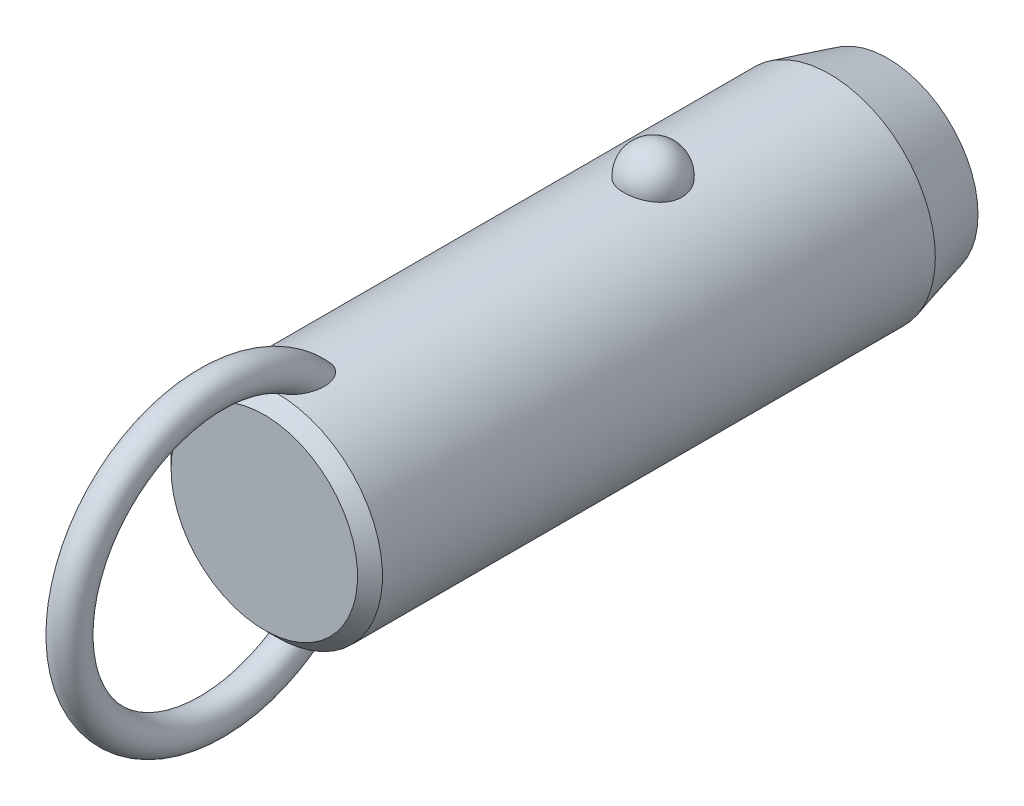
ISO-10303-21;
HEADER;
FILE_DESCRIPTION(('STEP AP214'),'2;1');
FILE_NAME('part.step','',(''),(''),'','','');
FILE_SCHEMA(('AUTOMOTIVE_DESIGN { 1 0 10303 214 1 1 1 1 }'));
ENDSEC;
DATA;
#1=APPLICATION_CONTEXT('core data for automotive mechanical design processes');
#2=APPLICATION_PROTOCOL_DEFINITION('international standard','automotive_design',2000,#1);
#3=PRODUCT_CONTEXT('',#1,'mechanical');
#4=PRODUCT('Part','Part','',(#3));
#5=PRODUCT_RELATED_PRODUCT_CATEGORY('part','',(#4));
#6=PRODUCT_DEFINITION_FORMATION('','',#4);
#7=PRODUCT_DEFINITION_CONTEXT('part definition',#1,'design');
#8=PRODUCT_DEFINITION('design','',#6,#7);
#9=PRODUCT_DEFINITION_SHAPE('','',#8);
#10=(LENGTH_UNIT() NAMED_UNIT(*) SI_UNIT(.MILLI.,.METRE.));
#11=(NAMED_UNIT(*) PLANE_ANGLE_UNIT() SI_UNIT($,.RADIAN.));
#12=(NAMED_UNIT(*) SI_UNIT($,.STERADIAN.) SOLID_ANGLE_UNIT());
#13=UNCERTAINTY_MEASURE_WITH_UNIT(LENGTH_MEASURE(1.E-05),#10,'distance_accuracy_value','');
#14=(GEOMETRIC_REPRESENTATION_CONTEXT(3) GLOBAL_UNCERTAINTY_ASSIGNED_CONTEXT((#13)) GLOBAL_UNIT_ASSIGNED_CONTEXT((#10,
#11,#12)) REPRESENTATION_CONTEXT('',''));
#15=CARTESIAN_POINT('',(0.,0.,0.));
#16=DIRECTION('',(0.,0.,1.));
#17=DIRECTION('',(1.,0.,0.));
#18=AXIS2_PLACEMENT_3D('',#15,#16,#17);
#19=CARTESIAN_POINT('',(0.,0.,30.5));
#20=DIRECTION('',(0.,0.,-1.));
#21=DIRECTION('',(-1.,0.,0.));
#22=AXIS2_PLACEMENT_3D('',#19,#20,#21);
#23=CYLINDRICAL_SURFACE('',#22,12.7);
#24=CARTESIAN_POINT('',(3.46661256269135,12.2177165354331,-3.5));
#25=CARTESIAN_POINT('',(3.4666090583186,12.2177194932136,-3.30432790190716));
#26=CARTESIAN_POINT('',(3.45063567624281,12.2222841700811,-3.10861112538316));
#27=CARTESIAN_POINT('',(3.38712451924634,12.2400345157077,-2.72271899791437));
#28=CARTESIAN_POINT('',(3.33957415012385,12.2532236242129,-2.53254588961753));
#29=CARTESIAN_POINT('',(3.2141234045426,12.286724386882,-2.16324948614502));
#30=CARTESIAN_POINT('',(3.13623639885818,12.3070329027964,-1.98412136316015));
#31=CARTESIAN_POINT('',(2.95205930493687,12.3525018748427,-1.64180592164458));
#32=CARTESIAN_POINT('',(2.84577003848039,12.3776621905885,-1.47861814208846));
#33=CARTESIAN_POINT('',(2.60688050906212,12.4301712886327,-1.17190583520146));
#34=CARTESIAN_POINT('',(2.47415697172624,12.4575299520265,-1.02847897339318));
#35=CARTESIAN_POINT('',(2.18615174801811,12.5112810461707,-0.766177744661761));
#36=CARTESIAN_POINT('',(2.03087002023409,12.5376734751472,-0.647303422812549));
#37=CARTESIAN_POINT('',(1.70237334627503,12.5864761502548,-0.437732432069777));
#38=CARTESIAN_POINT('',(1.52920948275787,12.6088972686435,-0.346958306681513));
#39=CARTESIAN_POINT('',(1.16944170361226,12.6473352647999,-0.195750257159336));
#40=CARTESIAN_POINT('',(0.982839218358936,12.663352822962,-0.13531310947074));
#41=CARTESIAN_POINT('',(0.604961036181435,12.6869706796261,-0.047324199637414));
#42=CARTESIAN_POINT('',(0.413823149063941,12.6947125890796,-0.0192185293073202));
#43=CARTESIAN_POINT('',(0.0293827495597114,12.7014203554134,0.00517254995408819));
#44=CARTESIAN_POINT('',(-0.163919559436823,12.7003870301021,0.00146092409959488));
#45=CARTESIAN_POINT('',(-0.544374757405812,12.689735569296,-0.0373939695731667));
#46=CARTESIAN_POINT('',(-0.731575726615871,12.6802364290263,-0.0721015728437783));
#47=CARTESIAN_POINT('',(-1.09733277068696,12.6538333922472,-0.17136478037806));
#48=CARTESIAN_POINT('',(-1.27588869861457,12.6369293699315,-0.235920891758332));
#49=CARTESIAN_POINT('',(-1.6204698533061,12.5973946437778,-0.393548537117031));
#50=CARTESIAN_POINT('',(-1.78641865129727,12.5747321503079,-0.486778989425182));
#51=CARTESIAN_POINT('',(-2.10030671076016,12.5261316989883,-0.699110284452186));
#52=CARTESIAN_POINT('',(-2.24824419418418,12.5001934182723,-0.818213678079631));
#53=CARTESIAN_POINT('',(-2.52491489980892,12.4472906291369,-1.08157124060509));
#54=CARTESIAN_POINT('',(-2.65324222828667,12.4203160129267,-1.22624992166));
#55=CARTESIAN_POINT('',(-2.88410007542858,12.3687509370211,-1.53528325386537));
#56=CARTESIAN_POINT('',(-2.98662883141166,12.3441606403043,-1.69963924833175));
#57=CARTESIAN_POINT('',(-3.16432417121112,12.2998199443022,-2.04548497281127));
#58=CARTESIAN_POINT('',(-3.23917525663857,12.2801261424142,-2.22714424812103));
#59=CARTESIAN_POINT('',(-3.35800573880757,12.248167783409,-2.6009138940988));
#60=CARTESIAN_POINT('',(-3.4019860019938,12.2359030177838,-2.79302397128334));
#61=CARTESIAN_POINT('',(-3.45784812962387,12.2202347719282,-3.18140279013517));
#62=CARTESIAN_POINT('',(-3.46986123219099,12.2167950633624,-3.37765118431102));
#63=CARTESIAN_POINT('',(-3.46186273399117,12.2190638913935,-3.76943689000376));
#64=CARTESIAN_POINT('',(-3.44185196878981,12.2247721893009,-3.96497421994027));
#65=CARTESIAN_POINT('',(-3.37048652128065,12.2446381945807,-4.34881728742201));
#66=CARTESIAN_POINT('',(-3.31928253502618,12.2587552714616,-4.53715319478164));
#67=CARTESIAN_POINT('',(-3.18693461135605,12.2938237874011,-4.90231727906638));
#68=CARTESIAN_POINT('',(-3.1057895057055,12.3147754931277,-5.07914500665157));
#69=CARTESIAN_POINT('',(-2.91506431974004,12.3613125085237,-5.41732059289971));
#70=CARTESIAN_POINT('',(-2.80533587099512,12.3869217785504,-5.57858147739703));
#71=CARTESIAN_POINT('',(-2.560414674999,12.4398525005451,-5.88013283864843));
#72=CARTESIAN_POINT('',(-2.42522099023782,12.4671740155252,-6.02042254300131));
#73=CARTESIAN_POINT('',(-2.1323357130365,12.5205965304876,-6.27662798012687));
#74=CARTESIAN_POINT('',(-1.97456596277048,12.5466928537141,-6.39245542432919));
#75=CARTESIAN_POINT('',(-1.64115839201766,12.5946384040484,-6.59583547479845));
#76=CARTESIAN_POINT('',(-1.46552179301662,12.6164879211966,-6.68339001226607));
#77=CARTESIAN_POINT('',(-1.10356050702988,12.6532533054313,-6.82682153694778));
#78=CARTESIAN_POINT('',(-0.917391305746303,12.6682500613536,-6.8830698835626));
#79=CARTESIAN_POINT('',(-0.537836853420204,12.6900288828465,-6.96386887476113));
#80=CARTESIAN_POINT('',(-0.344452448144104,12.6968119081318,-6.9884232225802));
#81=CARTESIAN_POINT('',(0.04025770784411,12.7013667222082,-7.00496469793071));
#82=CARTESIAN_POINT('',(0.231556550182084,12.6993008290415,-6.99753844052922));
#83=CARTESIAN_POINT('',(0.610105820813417,12.6867505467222,-6.9516636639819));
#84=CARTESIAN_POINT('',(0.797356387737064,12.6762664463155,-6.91321620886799));
#85=CARTESIAN_POINT('',(1.16186657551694,12.6480587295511,-6.80658431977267));
#86=CARTESIAN_POINT('',(1.33915951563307,12.6303611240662,-6.73850666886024));
#87=CARTESIAN_POINT('',(1.67968518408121,12.5896027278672,-6.57450875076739));
#88=CARTESIAN_POINT('',(1.84291705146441,12.5665416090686,-6.47858678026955));
#89=CARTESIAN_POINT('',(2.15340192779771,12.5171072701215,-6.25982455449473));
#90=CARTESIAN_POINT('',(2.30037831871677,12.4906895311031,-6.13660186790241));
#91=CARTESIAN_POINT('',(2.5717412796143,12.4376567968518,-5.86739587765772));
#92=CARTESIAN_POINT('',(2.69612388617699,12.4110417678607,-5.72140858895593));
#93=CARTESIAN_POINT('',(2.92107785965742,12.360051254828,-5.40794137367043));
#94=CARTESIAN_POINT('',(3.02121329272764,12.3357209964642,-5.24014110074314));
#95=CARTESIAN_POINT('',(3.19236291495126,12.2925446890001,-4.8896986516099));
#96=CARTESIAN_POINT('',(3.26338839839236,12.2736965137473,-4.70706226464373));
#97=CARTESIAN_POINT('',(3.36788038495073,12.245404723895,-4.35469510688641));
#98=CARTESIAN_POINT('',(3.40484026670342,12.2351018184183,-4.18605935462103));
#99=CARTESIAN_POINT('',(3.45420764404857,12.2212564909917,-3.84496058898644));
#100=CARTESIAN_POINT('',(3.46661565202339,12.2177139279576,-3.67249765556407));
#101=CARTESIAN_POINT('',(3.46661256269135,12.2177165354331,-3.5));
#102=B_SPLINE_CURVE_WITH_KNOTS('',3,(#24,#25,#26,#27,#28,#29,#30,#31,#32,#33,#34,#35,#36,#37,
#38,#39,#40,#41,#42,#43,#44,#45,#46,#47,#48,#49,#50,#51,#52,#53,#54,#55,#56,#57,#58,#59,#60,#61,
#62,#63,#64,#65,#66,#67,#68,#69,#70,#71,#72,#73,#74,#75,#76,#77,#78,#79,#80,#81,#82,#83,#84,#85,
#86,#87,#88,#89,#90,#91,#92,#93,#94,#95,#96,#97,#98,#99,#100,#101),.UNSPECIFIED.,.T.,.F.,(4,2,2,
2,2,2,2,2,2,2,2,2,2,2,2,2,2,2,2,2,2,2,2,2,2,2,2,2,2,2,2,2,2,2,2,2,2,2,4),(0.,0.586396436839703,
1.17302689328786,1.7593990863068,2.34575431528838,2.93491084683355,3.52406845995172,
4.11158733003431,4.69904375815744,5.2762784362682,5.85345931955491,6.42265312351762,
6.99185659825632,7.56427334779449,8.136746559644,8.71981013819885,9.3029135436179,
9.89247258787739,10.4820150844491,11.0691335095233,11.6562366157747,12.2405256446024,
12.8248374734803,13.412244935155,13.9996740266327,14.5891883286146,15.1786623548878,
15.7609861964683,16.3432419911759,16.914863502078,17.4864654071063,18.0560241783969,
18.6256177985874,19.2037609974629,19.7820055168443,20.3699810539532,20.9577282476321,
21.4746855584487,21.9916320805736),.UNSPECIFIED.);
#103=CARTESIAN_POINT('',(3.46661256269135,12.2177165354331,-3.5));
#104=VERTEX_POINT('',#103);
#105=EDGE_CURVE('E41',#104,#104,#102,.T.);
#106=ORIENTED_EDGE('',*,*,#105,.T.);
#107=EDGE_LOOP('',(#106));
#108=FACE_BOUND('',#107,.T.);
#109=CARTESIAN_POINT('',(0.,0.,41.7000000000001));
#110=DIRECTION('',(0.,0.,1.));
#111=DIRECTION('',(1.,0.,0.));
#112=AXIS2_PLACEMENT_3D('',#109,#110,#111);
#113=CIRCLE('',#112,12.7);
#114=CARTESIAN_POINT('',(-12.7,0.,41.7000000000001));
#115=VERTEX_POINT('',#114);
#116=EDGE_CURVE('E10',#115,#115,#113,.F.);
#117=ORIENTED_EDGE('',*,*,#116,.T.);
#118=EDGE_LOOP('',(#117));
#119=FACE_BOUND('',#118,.T.);
#120=CARTESIAN_POINT('',(-0.548122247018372,-12.6881662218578,35.4432187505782));
#121=CARTESIAN_POINT('',(-0.648865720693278,-12.6838128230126,35.477926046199));
#122=CARTESIAN_POINT('',(-0.746398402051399,-12.6783867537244,35.5220428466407));
#123=CARTESIAN_POINT('',(-0.932125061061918,-12.666091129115,35.6267647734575));
#124=CARTESIAN_POINT('',(-1.02030388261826,-12.6592192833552,35.687396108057));
#125=CARTESIAN_POINT('',(-1.18487740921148,-12.6448747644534,35.821847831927));
#126=CARTESIAN_POINT('',(-1.26134296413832,-12.637406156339,35.8955825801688));
#127=CARTESIAN_POINT('',(-1.4023120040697,-12.6225412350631,36.0536045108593));
#128=CARTESIAN_POINT('',(-1.46681470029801,-12.6151449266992,36.1378923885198));
#129=CARTESIAN_POINT('',(-1.60714786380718,-12.5981718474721,36.3496577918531));
#130=CARTESIAN_POINT('',(-1.67725126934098,-12.588900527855,36.480962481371));
#131=CARTESIAN_POINT('',(-1.79536591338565,-12.5725964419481,36.7532471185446));
#132=CARTESIAN_POINT('',(-1.84333535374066,-12.5655679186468,36.8942447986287));
#133=CARTESIAN_POINT('',(-1.93422576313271,-12.5519624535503,37.2376455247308));
#134=CARTESIAN_POINT('',(-1.96788773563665,-12.5466298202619,37.4425578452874));
#135=CARTESIAN_POINT('',(-1.9941399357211,-12.542463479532,37.7517600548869));
#136=CARTESIAN_POINT('',(-1.99883864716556,-12.5417153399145,37.8552987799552));
#137=CARTESIAN_POINT('',(-2.00078003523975,-12.5414074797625,38.0624512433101));
#138=CARTESIAN_POINT('',(-1.99802449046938,-12.5418474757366,38.1660649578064));
#139=CARTESIAN_POINT('',(-1.98336733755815,-12.5441750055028,38.4103207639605));
#140=CARTESIAN_POINT('',(-1.96851430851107,-12.5465291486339,38.5507804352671));
#141=CARTESIAN_POINT('',(-1.92707089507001,-12.5529612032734,38.8299607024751));
#142=CARTESIAN_POINT('',(-1.90047458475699,-12.5570399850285,38.9686803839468));
#143=CARTESIAN_POINT('',(-1.83619120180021,-12.5666008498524,39.2434113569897));
#144=CARTESIAN_POINT('',(-1.79850828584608,-12.57208240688,39.3794236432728));
#145=CARTESIAN_POINT('',(-1.71223796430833,-12.5841228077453,39.6478421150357));
#146=CARTESIAN_POINT('',(-1.66365679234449,-12.5906810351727,39.7802503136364));
#147=CARTESIAN_POINT('',(-1.57804503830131,-12.6016176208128,39.9854887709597));
#148=CARTESIAN_POINT('',(-1.54477252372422,-12.6057501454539,40.0599149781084));
#149=CARTESIAN_POINT('',(-1.47424480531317,-12.6141930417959,40.2068393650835));
#150=CARTESIAN_POINT('',(-1.43699041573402,-12.6185033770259,40.2793379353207));
#151=CARTESIAN_POINT('',(-1.35825795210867,-12.6272207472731,40.4218926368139));
#152=CARTESIAN_POINT('',(-1.31678520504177,-12.6316276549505,40.4919517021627));
#153=CARTESIAN_POINT('',(-1.22917793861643,-12.6404532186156,40.6290705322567));
#154=CARTESIAN_POINT('',(-1.18304514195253,-12.6448718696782,40.6961313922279));
#155=CARTESIAN_POINT('',(-1.0724641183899,-12.6547893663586,40.8438741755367));
#156=CARTESIAN_POINT('',(-1.00642239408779,-12.6602600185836,40.9233844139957));
#157=CARTESIAN_POINT('',(-0.86444142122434,-12.6707460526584,41.0731698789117));
#158=CARTESIAN_POINT('',(-0.788516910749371,-12.6757620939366,41.1434585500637));
#159=CARTESIAN_POINT('',(-0.652215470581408,-12.6833591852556,41.2486801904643));
#160=CARTESIAN_POINT('',(-0.594982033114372,-12.6861973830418,41.2876241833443));
#161=CARTESIAN_POINT('',(-0.475269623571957,-12.6912445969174,41.3564899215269));
#162=CARTESIAN_POINT('',(-0.412800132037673,-12.6934547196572,41.3864275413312));
#163=CARTESIAN_POINT('',(-0.29574972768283,-12.6966636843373,41.4297565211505));
#164=CARTESIAN_POINT('',(-0.241949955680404,-12.6978134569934,41.4452188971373));
#165=CARTESIAN_POINT('',(-0.132508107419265,-12.6994261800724,41.4668845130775));
#166=CARTESIAN_POINT('',(-0.0768679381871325,-12.6998898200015,41.4730970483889));
#167=CARTESIAN_POINT('',(0.0347696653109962,-12.7000752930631,41.4755838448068));
#168=CARTESIAN_POINT('',(0.0907676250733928,-12.6997954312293,41.4718353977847));
#169=CARTESIAN_POINT('',(0.201283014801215,-12.6985255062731,41.4547883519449));
#170=CARTESIAN_POINT('',(0.255799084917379,-12.6975348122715,41.4414812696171));
#171=CARTESIAN_POINT('',(0.376042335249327,-12.6946091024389,41.4020379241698));
#172=CARTESIAN_POINT('',(0.440950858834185,-12.6924943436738,41.3734492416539));
#173=CARTESIAN_POINT('',(0.565350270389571,-12.6875639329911,41.3063234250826));
#174=CARTESIAN_POINT('',(0.624828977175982,-12.6847467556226,41.2677646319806));
#175=CARTESIAN_POINT('',(0.774116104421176,-12.6767252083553,41.156949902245));
#176=CARTESIAN_POINT('',(0.859449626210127,-12.6711344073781,41.0787605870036));
#177=CARTESIAN_POINT('',(1.01789440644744,-12.6593922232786,40.910943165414));
#178=CARTESIAN_POINT('',(1.09096902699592,-12.653239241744,40.821282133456));
#179=CARTESIAN_POINT('',(1.22268793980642,-12.6411674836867,40.6402658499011));
#180=CARTESIAN_POINT('',(1.28193986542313,-12.6352572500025,40.549345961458));
#181=CARTESIAN_POINT('',(1.39259777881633,-12.6235401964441,40.3627929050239));
#182=CARTESIAN_POINT('',(1.44399707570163,-12.6177334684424,40.2671558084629));
#183=CARTESIAN_POINT('',(1.53972870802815,-12.6064093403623,40.0722738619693));
#184=CARTESIAN_POINT('',(1.58405262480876,-12.6008922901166,39.9730248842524));
#185=CARTESIAN_POINT('',(1.66600705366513,-12.5903187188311,39.7717727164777));
#186=CARTESIAN_POINT('',(1.70363651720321,-12.5852622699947,39.6697690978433));
#187=CARTESIAN_POINT('',(1.77545379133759,-12.5753406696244,39.4543580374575));
#188=CARTESIAN_POINT('',(1.80903453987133,-12.5705328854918,39.340745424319));
#189=CARTESIAN_POINT('',(1.86844163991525,-12.5618400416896,39.1114575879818));
#190=CARTESIAN_POINT('',(1.89426665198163,-12.5579551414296,38.9957820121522));
#191=CARTESIAN_POINT('',(1.9378546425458,-12.5513030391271,38.7630072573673));
#192=CARTESIAN_POINT('',(1.9556264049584,-12.5485346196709,38.6459097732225));
#193=CARTESIAN_POINT('',(1.98264463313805,-12.5442934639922,38.4107473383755));
#194=CARTESIAN_POINT('',(1.99189298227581,-12.5428204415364,38.2926826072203));
#195=CARTESIAN_POINT('',(2.00416068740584,-12.540871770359,37.9806225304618));
#196=CARTESIAN_POINT('',(1.99944433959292,-12.541631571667,37.7862290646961));
#197=CARTESIAN_POINT('',(1.96113755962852,-12.5476846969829,37.4003095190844));
#198=CARTESIAN_POINT('',(1.92758341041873,-12.5529723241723,37.2087801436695));
#199=CARTESIAN_POINT('',(1.8393434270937,-12.5661532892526,36.8822728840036));
#200=CARTESIAN_POINT('',(1.79215440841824,-12.5730485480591,36.7452499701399));
#201=CARTESIAN_POINT('',(1.67676242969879,-12.588958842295,36.4804459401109));
#202=CARTESIAN_POINT('',(1.60859050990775,-12.597970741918,36.3526515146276));
#203=CARTESIAN_POINT('',(1.46583832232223,-12.6152829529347,36.1358006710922));
#204=CARTESIAN_POINT('',(1.39525727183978,-12.6233659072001,36.0441050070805));
#205=CARTESIAN_POINT('',(1.23992594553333,-12.6395676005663,35.8734854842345));
#206=CARTESIAN_POINT('',(1.15517932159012,-12.6476863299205,35.7945583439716));
#207=CARTESIAN_POINT('',(0.971995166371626,-12.6630846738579,35.6526438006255));
#208=CARTESIAN_POINT('',(0.87345644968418,-12.6703572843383,35.5897849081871));
#209=CARTESIAN_POINT('',(0.665847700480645,-12.6829569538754,35.4844870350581));
#210=CARTESIAN_POINT('',(0.556784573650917,-12.688285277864,35.4420347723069));
#211=CARTESIAN_POINT('',(0.347338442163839,-12.6956226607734,35.3844434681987));
#212=CARTESIAN_POINT('',(0.247759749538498,-12.6979816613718,35.3663996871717));
#213=CARTESIAN_POINT('',(0.0470218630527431,-12.7003077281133,35.3486007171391));
#214=CARTESIAN_POINT('',(-0.0541350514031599,-12.7002779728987,35.3488212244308));
#215=CARTESIAN_POINT('',(-0.221414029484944,-12.6982482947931,35.3643639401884));
#216=CARTESIAN_POINT('',(-0.288055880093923,-12.6969033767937,35.3746662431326));
#217=CARTESIAN_POINT('',(-0.419599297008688,-12.6932369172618,35.4031348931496));
#218=CARTESIAN_POINT('',(-0.484501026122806,-12.6909154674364,35.4213005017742));
#219=CARTESIAN_POINT('',(-0.548122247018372,-12.6881662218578,35.4432187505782));
#220=B_SPLINE_CURVE_WITH_KNOTS('',3,(#120,#121,#122,#123,#124,#125,#126,#127,#128,#129,#130,
#131,#132,#133,#134,#135,#136,#137,#138,#139,#140,#141,#142,#143,#144,#145,#146,#147,#148,#149,
#150,#151,#152,#153,#154,#155,#156,#157,#158,#159,#160,#161,#162,#163,#164,#165,#166,#167,#168,
#169,#170,#171,#172,#173,#174,#175,#176,#177,#178,#179,#180,#181,#182,#183,#184,#185,#186,#187,
#188,#189,#190,#191,#192,#193,#194,#195,#196,#197,#198,#199,#200,#201,#202,#203,#204,#205,#206,
#207,#208,#209,#210,#211,#212,#213,#214,#215,#216,#217,#218,#219),.UNSPECIFIED.,.T.,.F.,(4,2,2,
2,2,2,2,2,2,2,2,2,2,2,2,2,2,2,2,2,2,2,2,2,2,2,2,2,2,2,2,2,2,2,2,2,2,2,2,2,2,2,2,2,2,2,2,2,2,4),
(0.,0.319642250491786,0.63979475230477,0.957927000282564,1.27608021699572,1.72100165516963,
2.16675988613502,2.78630021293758,3.09705782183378,3.40774128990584,3.83096358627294,
4.2543996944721,4.67767724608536,5.10071330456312,5.34550297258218,5.59024267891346,
5.83467707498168,6.07902143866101,6.38891080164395,6.69834321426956,6.90560910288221,
7.11250749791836,7.27977315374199,7.44687060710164,7.61434932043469,7.78197685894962,
7.99365544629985,8.20579780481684,8.55147335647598,8.8981642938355,9.22375138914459,
9.54961437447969,9.8758622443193,10.202161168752,10.557587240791,10.9130746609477,
11.2681734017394,11.6231936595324,12.2046601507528,12.7853961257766,13.219164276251,
13.6522938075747,13.9989174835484,14.3454519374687,14.6946768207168,15.0436740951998,
15.3457513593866,15.6474266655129,15.8493051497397,16.0511646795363),.UNSPECIFIED.);
#221=CARTESIAN_POINT('',(-0.548122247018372,-12.6881662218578,35.4432187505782));
#222=VERTEX_POINT('',#221);
#223=EDGE_CURVE('E60',#222,#222,#220,.T.);
#224=ORIENTED_EDGE('',*,*,#223,.T.);
#225=EDGE_LOOP('',(#224));
#226=FACE_BOUND('',#225,.T.);
#227=CARTESIAN_POINT('',(-0.548122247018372,12.6881662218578,35.4432187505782));
#228=CARTESIAN_POINT('',(-0.459436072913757,12.6919968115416,35.412673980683));
#229=CARTESIAN_POINT('',(-0.368189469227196,12.6949996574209,35.3893913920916));
#230=CARTESIAN_POINT('',(-0.183024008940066,12.6990186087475,35.3584062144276));
#231=CARTESIAN_POINT('',(-0.089104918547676,12.7000345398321,35.3507049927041));
#232=CARTESIAN_POINT('',(0.0987147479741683,12.6999636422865,35.3512455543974));
#233=CARTESIAN_POINT('',(0.192615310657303,12.6988761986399,35.3594920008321));
#234=CARTESIAN_POINT('',(0.377658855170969,12.6947211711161,35.3915515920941));
#235=CARTESIAN_POINT('',(0.46880177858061,12.6916535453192,35.4153650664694));
#236=CARTESIAN_POINT('',(0.645809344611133,12.6838788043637,35.4774565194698));
#237=CARTESIAN_POINT('',(0.731679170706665,12.6791733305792,35.515720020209));
#238=CARTESIAN_POINT('',(0.896315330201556,12.6686004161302,35.605120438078));
#239=CARTESIAN_POINT('',(0.975080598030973,12.6627328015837,35.6562592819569));
#240=CARTESIAN_POINT('',(1.12963655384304,12.6499161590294,35.7736782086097));
#241=CARTESIAN_POINT('',(1.20478673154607,12.6429194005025,35.8407929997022));
#242=CARTESIAN_POINT('',(1.34448241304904,12.6288282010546,35.9852250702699));
#243=CARTESIAN_POINT('',(1.40902173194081,12.621733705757,36.0625482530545));
#244=CARTESIAN_POINT('',(1.55208211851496,12.6050877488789,36.2592475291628));
#245=CARTESIAN_POINT('',(1.62510490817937,12.5957546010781,36.3826540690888));
#246=CARTESIAN_POINT('',(1.7501904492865,12.5789823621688,36.6397690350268));
#247=CARTESIAN_POINT('',(1.80221377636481,12.5715468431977,36.773496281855));
#248=CARTESIAN_POINT('',(1.90309965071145,12.5567434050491,37.0983516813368));
#249=CARTESIAN_POINT('',(1.94342317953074,12.5504515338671,37.2921611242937));
#250=CARTESIAN_POINT('',(1.99332997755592,12.5426147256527,37.6837881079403));
#251=CARTESIAN_POINT('',(2.00285305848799,12.5410790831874,37.8816127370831));
#252=CARTESIAN_POINT('',(1.99678999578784,12.5420407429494,38.2166427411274));
#253=CARTESIAN_POINT('',(1.98794117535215,12.5434564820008,38.3540428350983));
#254=CARTESIAN_POINT('',(1.95865119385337,12.5480641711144,38.6276394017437));
#255=CARTESIAN_POINT('',(1.93820436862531,12.5512569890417,38.7638352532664));
#256=CARTESIAN_POINT('',(1.88647896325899,12.5591352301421,39.0342493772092));
#257=CARTESIAN_POINT('',(1.85518800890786,12.5638223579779,39.1684652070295));
#258=CARTESIAN_POINT('',(1.78217886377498,12.5743868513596,39.4339362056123));
#259=CARTESIAN_POINT('',(1.74046509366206,12.5802637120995,39.5651926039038));
#260=CARTESIAN_POINT('',(1.66024095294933,12.5910571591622,39.7860855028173));
#261=CARTESIAN_POINT('',(1.62434772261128,12.5957535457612,39.8766904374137));
#262=CARTESIAN_POINT('',(1.54709009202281,12.6054762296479,40.0555125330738));
#263=CARTESIAN_POINT('',(1.50572681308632,12.6105024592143,40.1437301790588));
#264=CARTESIAN_POINT('',(1.41728020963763,12.620748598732,40.3169321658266));
#265=CARTESIAN_POINT('',(1.37021377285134,12.625967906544,40.4019251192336));
#266=CARTESIAN_POINT('',(1.26969620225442,12.6364721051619,40.5680072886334));
#267=CARTESIAN_POINT('',(1.21624929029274,12.6417569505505,40.6490990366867));
#268=CARTESIAN_POINT('',(1.10304413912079,12.6521331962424,40.8047027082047));
#269=CARTESIAN_POINT('',(1.04340936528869,12.657226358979,40.8793033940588));
#270=CARTESIAN_POINT('',(0.915919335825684,12.6670906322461,41.021324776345));
#271=CARTESIAN_POINT('',(0.848064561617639,12.6718617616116,41.0887458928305));
#272=CARTESIAN_POINT('',(0.717035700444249,12.67987711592,41.2006247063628));
#273=CARTESIAN_POINT('',(0.655526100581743,12.6832377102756,41.2469970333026));
#274=CARTESIAN_POINT('',(0.525985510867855,12.6892676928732,41.3296195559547));
#275=CARTESIAN_POINT('',(0.457969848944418,12.6919386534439,41.3658927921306));
#276=CARTESIAN_POINT('',(0.334859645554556,12.695691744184,41.4166572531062));
#277=CARTESIAN_POINT('',(0.281116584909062,12.6970073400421,41.4343733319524));
#278=CARTESIAN_POINT('',(0.171425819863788,12.6989609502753,41.4606429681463));
#279=CARTESIAN_POINT('',(0.115480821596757,12.699599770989,41.4692074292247));
#280=CARTESIAN_POINT('',(0.00272618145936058,12.7001251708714,41.4762531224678));
#281=CARTESIAN_POINT('',(-0.0540859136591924,12.7000089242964,41.4746964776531));
#282=CARTESIAN_POINT('',(-0.166544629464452,12.6990328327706,41.4616005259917));
#283=CARTESIAN_POINT('',(-0.222190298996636,12.6981724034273,41.4500533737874));
#284=CARTESIAN_POINT('',(-0.342018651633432,12.695562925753,41.4149128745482));
#285=CARTESIAN_POINT('',(-0.405606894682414,12.6936676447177,41.3893322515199));
#286=CARTESIAN_POINT('',(-0.527815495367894,12.6891754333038,41.3283111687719));
#287=CARTESIAN_POINT('',(-0.586425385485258,12.6865770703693,41.2928505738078));
#288=CARTESIAN_POINT('',(-0.731842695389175,12.6792129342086,41.1914960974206));
#289=CARTESIAN_POINT('',(-0.814709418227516,12.6740767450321,41.1200395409));
#290=CARTESIAN_POINT('',(-0.969101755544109,12.6632083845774,40.9658900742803));
#291=CARTESIAN_POINT('',(-1.04059564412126,12.6574746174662,40.8831668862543));
#292=CARTESIAN_POINT('',(-1.1698111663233,12.6461638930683,40.7158096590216));
#293=CARTESIAN_POINT('',(-1.22811369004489,12.6405994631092,40.6316166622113));
#294=CARTESIAN_POINT('',(-1.33743405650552,12.6295007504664,40.4585791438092));
#295=CARTESIAN_POINT('',(-1.38844577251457,12.6239664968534,40.3697307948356));
#296=CARTESIAN_POINT('',(-1.48400702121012,12.6130898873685,40.188389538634));
#297=CARTESIAN_POINT('',(-1.52854232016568,12.6077479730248,40.0958891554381));
#298=CARTESIAN_POINT('',(-1.61150113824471,12.5974127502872,39.9081607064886));
#299=CARTESIAN_POINT('',(-1.64992317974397,12.5924195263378,39.8129319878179));
#300=CARTESIAN_POINT('',(-1.73468589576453,12.581070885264,39.5828936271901));
#301=CARTESIAN_POINT('',(-1.77831261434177,12.5749388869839,39.4470661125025));
#302=CARTESIAN_POINT('',(-1.85439734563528,12.5639437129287,39.1722128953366));
#303=CARTESIAN_POINT('',(-1.88684994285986,12.5590811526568,39.0331856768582));
#304=CARTESIAN_POINT('',(-1.9400848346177,12.550968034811,38.7530923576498));
#305=CARTESIAN_POINT('',(-1.96088706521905,12.5477147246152,38.6120301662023));
#306=CARTESIAN_POINT('',(-1.99000539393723,12.5431291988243,38.3286689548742));
#307=CARTESIAN_POINT('',(-1.99832911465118,12.5417958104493,38.1863707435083));
#308=CARTESIAN_POINT('',(-2.00166624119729,12.5412674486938,37.8576271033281));
#309=CARTESIAN_POINT('',(-1.99178843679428,12.5428579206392,37.671088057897));
#310=CARTESIAN_POINT('',(-1.9445518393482,12.5502731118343,37.3016240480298));
#311=CARTESIAN_POINT('',(-1.90724032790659,12.5560905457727,37.1186934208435));
#312=CARTESIAN_POINT('',(-1.81330718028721,12.5699462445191,36.8048488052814));
#313=CARTESIAN_POINT('',(-1.76338820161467,12.5771273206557,36.6719105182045));
#314=CARTESIAN_POINT('',(-1.64305018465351,12.593414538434,36.4156813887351));
#315=CARTESIAN_POINT('',(-1.57265346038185,12.6025185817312,36.292380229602));
#316=CARTESIAN_POINT('',(-1.42634956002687,12.6198178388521,36.0835648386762));
#317=CARTESIAN_POINT('',(-1.35423772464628,12.6278405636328,35.9953846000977));
#318=CARTESIAN_POINT('',(-1.19645664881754,12.6437632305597,35.8321079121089));
#319=CARTESIAN_POINT('',(-1.11080536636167,12.6516633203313,35.7569944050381));
#320=CARTESIAN_POINT('',(-0.947219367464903,12.6648319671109,35.6378114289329));
#321=CARTESIAN_POINT('',(-0.871624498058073,12.670300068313,35.5905414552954));
#322=CARTESIAN_POINT('',(-0.714161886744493,12.6801492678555,35.5077413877));
#323=CARTESIAN_POINT('',(-0.632295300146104,12.684530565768,35.4722091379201));
#324=CARTESIAN_POINT('',(-0.548122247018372,12.6881662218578,35.4432187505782));
#325=B_SPLINE_CURVE_WITH_KNOTS('',3,(#227,#228,#229,#230,#231,#232,#233,#234,#235,#236,#237,
#238,#239,#240,#241,#242,#243,#244,#245,#246,#247,#248,#249,#250,#251,#252,#253,#254,#255,#256,
#257,#258,#259,#260,#261,#262,#263,#264,#265,#266,#267,#268,#269,#270,#271,#272,#273,#274,#275,
#276,#277,#278,#279,#280,#281,#282,#283,#284,#285,#286,#287,#288,#289,#290,#291,#292,#293,#294,
#295,#296,#297,#298,#299,#300,#301,#302,#303,#304,#305,#306,#307,#308,#309,#310,#311,#312,#313,
#314,#315,#316,#317,#318,#319,#320,#321,#322,#323,#324),.UNSPECIFIED.,.T.,.F.,(4,2,2,2,2,2,2,2,
2,2,2,2,2,2,2,2,2,2,2,2,2,2,2,2,2,2,2,2,2,2,2,2,2,2,2,2,2,2,2,2,2,2,2,2,2,2,2,2,4),(0.,
0.281328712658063,0.56268211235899,0.844117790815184,1.12555942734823,1.40671982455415,
1.68792232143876,1.98972294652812,2.2916988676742,2.72039860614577,3.14989948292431,
3.74084916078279,4.3329529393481,4.74554109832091,5.15833092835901,5.5715933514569,
5.98468079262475,6.27722775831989,6.56971484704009,6.86135609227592,7.15280542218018,
7.43927407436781,7.7257259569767,7.9563586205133,8.18646071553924,8.35559393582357,
8.52452541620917,8.69408946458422,8.86378678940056,9.06834348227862,9.27332014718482,
9.60010414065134,9.92778432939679,10.2350252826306,10.5425229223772,10.8506864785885,
11.1589244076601,11.5867893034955,12.0148612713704,12.4421984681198,12.8692745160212,
13.4279365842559,13.9856380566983,14.4107062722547,14.8353130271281,15.1765567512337,
15.5173516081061,15.7844129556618,16.051425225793),.UNSPECIFIED.);
#326=CARTESIAN_POINT('',(-0.548122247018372,12.6881662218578,35.4432187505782));
#327=VERTEX_POINT('',#326);
#328=EDGE_CURVE('E68',#327,#327,#325,.T.);
#329=ORIENTED_EDGE('',*,*,#328,.T.);
#330=EDGE_LOOP('',(#329));
#331=FACE_BOUND('',#330,.T.);
#332=CARTESIAN_POINT('',(0.,0.,-24.7));
#333=DIRECTION('',(0.,0.,-1.));
#334=DIRECTION('',(-1.,0.,0.));
#335=AXIS2_PLACEMENT_3D('',#332,#333,#334);
#336=CIRCLE('',#335,12.7);
#337=CARTESIAN_POINT('',(12.7,0.,-24.7));
#338=VERTEX_POINT('',#337);
#339=EDGE_CURVE('E57',#338,#338,#336,.F.);
#340=ORIENTED_EDGE('',*,*,#339,.T.);
#341=EDGE_LOOP('',(#340));
#342=FACE_BOUND('',#341,.T.);
#343=ADVANCED_FACE('F37',(#108,#119,#226,#331,#342),#23,.T.);
#344=CARTESIAN_POINT('',(0.,0.,-31.7));
#345=DIRECTION('',(0.,0.,-1.));
#346=DIRECTION('',(-1.,0.,0.));
#347=AXIS2_PLACEMENT_3D('',#344,#345,#346);
#348=PLANE('',#347);
#349=CARTESIAN_POINT('',(0.,0.,-31.7));
#350=DIRECTION('',(0.,0.,-1.));
#351=DIRECTION('',(-1.,0.,0.));
#352=AXIS2_PLACEMENT_3D('',#349,#350,#351);
#353=CIRCLE('',#352,10.8243556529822);
#354=CARTESIAN_POINT('',(10.8243556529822,0.,-31.7));
#355=VERTEX_POINT('',#354);
#356=EDGE_CURVE('E67',#355,#355,#353,.T.);
#357=ORIENTED_EDGE('',*,*,#356,.T.);
#358=EDGE_LOOP('',(#357));
#359=FACE_BOUND('',#358,.T.);
#360=ADVANCED_FACE('F86',(#359),#348,.T.);
#361=CARTESIAN_POINT('',(0.,0.,-31.7));
#362=DIRECTION('',(0.,0.,1.));
#363=DIRECTION('',(1.,0.,0.));
#364=AXIS2_PLACEMENT_3D('',#361,#362,#363);
#365=CONICAL_SURFACE('',#364,10.8243556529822,0.261799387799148);
#366=CARTESIAN_POINT('',(12.7,0.,-24.7));
#367=CARTESIAN_POINT('',(12.6804620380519,0.,-24.7729166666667));
#368=CARTESIAN_POINT('',(12.6609240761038,0.,-24.8458333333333));
#369=CARTESIAN_POINT('',(12.6218481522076,0.,-24.9916666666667));
#370=CARTESIAN_POINT('',(12.6023101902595,0.,-25.0645833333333));
#371=CARTESIAN_POINT('',(12.5632342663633,0.,-25.2104166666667));
#372=CARTESIAN_POINT('',(12.5436963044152,0.,-25.2833333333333));
#373=CARTESIAN_POINT('',(12.504620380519,0.,-25.4291666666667));
#374=CARTESIAN_POINT('',(12.4850824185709,0.,-25.5020833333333));
#375=CARTESIAN_POINT('',(12.4460064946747,0.,-25.6479166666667));
#376=CARTESIAN_POINT('',(12.4264685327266,0.,-25.7208333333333));
#377=CARTESIAN_POINT('',(12.3873926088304,0.,-25.8666666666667));
#378=CARTESIAN_POINT('',(12.3678546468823,0.,-25.9395833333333));
#379=CARTESIAN_POINT('',(12.3287787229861,0.,-26.0854166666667));
#380=CARTESIAN_POINT('',(12.3092407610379,0.,-26.1583333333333));
#381=CARTESIAN_POINT('',(12.2701648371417,0.,-26.3041666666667));
#382=CARTESIAN_POINT('',(12.2506268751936,0.,-26.3770833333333));
#383=CARTESIAN_POINT('',(12.2115509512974,0.,-26.5229166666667));
#384=CARTESIAN_POINT('',(12.1920129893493,0.,-26.5958333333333));
#385=CARTESIAN_POINT('',(12.1529370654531,0.,-26.7416666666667));
#386=CARTESIAN_POINT('',(12.133399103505,0.,-26.8145833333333));
#387=CARTESIAN_POINT('',(12.0943231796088,0.,-26.9604166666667));
#388=CARTESIAN_POINT('',(12.0747852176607,0.,-27.0333333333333));
#389=CARTESIAN_POINT('',(12.0357092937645,0.,-27.1791666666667));
#390=CARTESIAN_POINT('',(12.0161713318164,0.,-27.2520833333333));
#391=CARTESIAN_POINT('',(11.9770954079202,0.,-27.3979166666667));
#392=CARTESIAN_POINT('',(11.9575574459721,0.,-27.4708333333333));
#393=CARTESIAN_POINT('',(11.9184815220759,0.,-27.6166666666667));
#394=CARTESIAN_POINT('',(11.8989435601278,0.,-27.6895833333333));
#395=CARTESIAN_POINT('',(11.8598676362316,0.,-27.8354166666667));
#396=CARTESIAN_POINT('',(11.8403296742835,0.,-27.9083333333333));
#397=CARTESIAN_POINT('',(11.8012537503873,0.,-28.0541666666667));
#398=CARTESIAN_POINT('',(11.7817157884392,0.,-28.1270833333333));
#399=CARTESIAN_POINT('',(11.742639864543,0.,-28.2729166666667));
#400=CARTESIAN_POINT('',(11.7231019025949,0.,-28.3458333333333));
#401=CARTESIAN_POINT('',(11.6840259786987,0.,-28.4916666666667));
#402=CARTESIAN_POINT('',(11.6644880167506,0.,-28.5645833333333));
#403=CARTESIAN_POINT('',(11.6254120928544,0.,-28.7104166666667));
#404=CARTESIAN_POINT('',(11.6058741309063,0.,-28.7833333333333));
#405=CARTESIAN_POINT('',(11.5667982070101,0.,-28.9291666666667));
#406=CARTESIAN_POINT('',(11.5472602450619,0.,-29.0020833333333));
#407=CARTESIAN_POINT('',(11.5081843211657,0.,-29.1479166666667));
#408=CARTESIAN_POINT('',(11.4886463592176,0.,-29.2208333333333));
#409=CARTESIAN_POINT('',(11.4495704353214,0.,-29.3666666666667));
#410=CARTESIAN_POINT('',(11.4300324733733,0.,-29.4395833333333));
#411=CARTESIAN_POINT('',(11.3909565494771,0.,-29.5854166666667));
#412=CARTESIAN_POINT('',(11.371418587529,0.,-29.6583333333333));
#413=CARTESIAN_POINT('',(11.3323426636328,0.,-29.8041666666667));
#414=CARTESIAN_POINT('',(11.3128047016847,0.,-29.8770833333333));
#415=CARTESIAN_POINT('',(11.2737287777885,0.,-30.0229166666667));
#416=CARTESIAN_POINT('',(11.2541908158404,0.,-30.0958333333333));
#417=CARTESIAN_POINT('',(11.2151148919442,0.,-30.2416666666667));
#418=CARTESIAN_POINT('',(11.1955769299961,0.,-30.3145833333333));
#419=CARTESIAN_POINT('',(11.1565010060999,0.,-30.4604166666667));
#420=CARTESIAN_POINT('',(11.1369630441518,0.,-30.5333333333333));
#421=CARTESIAN_POINT('',(11.0978871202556,0.,-30.6791666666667));
#422=CARTESIAN_POINT('',(11.0783491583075,0.,-30.7520833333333));
#423=CARTESIAN_POINT('',(11.0392732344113,0.,-30.8979166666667));
#424=CARTESIAN_POINT('',(11.0197352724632,0.,-30.9708333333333));
#425=CARTESIAN_POINT('',(10.980659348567,0.,-31.1166666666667));
#426=CARTESIAN_POINT('',(10.9611213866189,0.,-31.1895833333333));
#427=CARTESIAN_POINT('',(10.9220454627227,0.,-31.3354166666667));
#428=CARTESIAN_POINT('',(10.9025075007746,0.,-31.4083333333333));
#429=CARTESIAN_POINT('',(10.8634315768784,0.,-31.5541666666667));
#430=CARTESIAN_POINT('',(10.8438936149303,0.,-31.6270833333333));
#431=CARTESIAN_POINT('',(10.8243556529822,0.,-31.7));
#432=B_SPLINE_CURVE_WITH_KNOTS('',3,(#366,#367,#368,#369,#370,#371,#372,#373,#374,#375,#376,
#377,#378,#379,#380,#381,#382,#383,#384,#385,#386,#387,#388,#389,#390,#391,#392,#393,#394,#395,
#396,#397,#398,#399,#400,#401,#402,#403,#404,#405,#406,#407,#408,#409,#410,#411,#412,#413,#414,
#415,#416,#417,#418,#419,#420,#421,#422,#423,#424,#425,#426,#427,#428,#429,#430,#431),
.UNSPECIFIED.,.F.,.F.,(4,2,2,2,2,2,2,2,2,2,2,2,2,2,2,2,2,2,2,2,2,2,2,2,2,2,2,2,2,2,2,2,4),(0.,
0.226466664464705,0.452933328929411,0.679399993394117,0.905866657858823,1.13233332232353,
1.35879998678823,1.58526665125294,1.81173331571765,2.03819998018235,2.26466664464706,
2.49113330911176,2.71759997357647,2.94406663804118,3.17053330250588,3.39699996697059,
3.62346663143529,3.8499332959,4.0763999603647,4.30286662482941,4.52933328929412,
4.75579995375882,4.98226661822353,5.20873328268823,5.43519994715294,5.66166661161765,
5.88813327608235,6.11459994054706,6.34106660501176,6.56753326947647,6.79399993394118,
7.02046659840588,7.24693326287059),.UNSPECIFIED.);
#433=EDGE_CURVE('BSEAM84',#338,#355,#432,.T.);
#434=ORIENTED_EDGE('',*,*,#339,.F.);
#435=ORIENTED_EDGE('',*,*,#356,.F.);
#436=ORIENTED_EDGE('',*,*,#433,.T.);
#437=ORIENTED_EDGE('',*,*,#433,.F.);
#438=EDGE_LOOP('',(#434,#436,#435,#437));
#439=FACE_BOUND('',#438,.T.);
#440=ADVANCED_FACE('F84',(#439),#365,.T.);
#441=CARTESIAN_POINT('',(0.,0.,43.2));
#442=DIRECTION('',(0.,0.,1.));
#443=DIRECTION('',(1.,0.,0.));
#444=AXIS2_PLACEMENT_3D('',#441,#442,#443);
#445=PLANE('',#444);
#446=CARTESIAN_POINT('',(0.,0.,43.2));
#447=DIRECTION('',(0.,0.,1.));
#448=DIRECTION('',(1.,0.,0.));
#449=AXIS2_PLACEMENT_3D('',#446,#447,#448);
#450=CIRCLE('',#449,11.2000000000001);
#451=CARTESIAN_POINT('',(-11.2000000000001,0.,43.2));
#452=VERTEX_POINT('',#451);
#453=EDGE_CURVE('E50',#452,#452,#450,.T.);
#454=ORIENTED_EDGE('',*,*,#453,.T.);
#455=EDGE_LOOP('',(#454));
#456=FACE_BOUND('',#455,.T.);
#457=ADVANCED_FACE('F78',(#456),#445,.T.);
#458=CARTESIAN_POINT('',(0.,0.,49.55));
#459=DIRECTION('',(1.,0.,0.));
#460=DIRECTION('',(0.,0.,-1.));
#461=AXIS2_PLACEMENT_3D('',#458,#459,#460);
#462=TOROIDAL_SURFACE('',#461,17.05,2.);
#463=ORIENTED_EDGE('',*,*,#328,.F.);
#464=EDGE_LOOP('',(#463));
#465=FACE_BOUND('',#464,.T.);
#466=ORIENTED_EDGE('',*,*,#223,.F.);
#467=EDGE_LOOP('',(#466));
#468=FACE_BOUND('',#467,.T.);
#469=ADVANCED_FACE('F74',(#465,#468),#462,.T.);
#470=CARTESIAN_POINT('',(0.,0.,43.2));
#471=DIRECTION('',(0.,0.,-1.));
#472=DIRECTION('',(-1.,0.,0.));
#473=AXIS2_PLACEMENT_3D('',#470,#471,#472);
#474=CONICAL_SURFACE('',#473,11.2000000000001,0.785398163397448);
#475=CARTESIAN_POINT('',(-12.7,0.,41.7000000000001));
#476=CARTESIAN_POINT('',(-12.684375,0.,41.7156250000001));
#477=CARTESIAN_POINT('',(-12.66875,0.,41.7312500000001));
#478=CARTESIAN_POINT('',(-12.6375,0.,41.7625000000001));
#479=CARTESIAN_POINT('',(-12.621875,0.,41.7781250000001));
#480=CARTESIAN_POINT('',(-12.590625,0.,41.8093750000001));
#481=CARTESIAN_POINT('',(-12.575,0.,41.8250000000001));
#482=CARTESIAN_POINT('',(-12.54375,0.,41.8562500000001));
#483=CARTESIAN_POINT('',(-12.528125,0.,41.8718750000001));
#484=CARTESIAN_POINT('',(-12.496875,0.,41.9031250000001));
#485=CARTESIAN_POINT('',(-12.48125,0.,41.9187500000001));
#486=CARTESIAN_POINT('',(-12.45,0.,41.9500000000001));
#487=CARTESIAN_POINT('',(-12.434375,0.,41.9656250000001));
#488=CARTESIAN_POINT('',(-12.403125,0.,41.9968750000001));
#489=CARTESIAN_POINT('',(-12.3875,0.,42.0125000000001));
#490=CARTESIAN_POINT('',(-12.35625,0.,42.0437500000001));
#491=CARTESIAN_POINT('',(-12.340625,0.,42.0593750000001));
#492=CARTESIAN_POINT('',(-12.309375,0.,42.090625));
#493=CARTESIAN_POINT('',(-12.29375,0.,42.10625));
#494=CARTESIAN_POINT('',(-12.2625,0.,42.1375));
#495=CARTESIAN_POINT('',(-12.246875,0.,42.153125));
#496=CARTESIAN_POINT('',(-12.215625,0.,42.184375));
#497=CARTESIAN_POINT('',(-12.2,0.,42.2));
#498=CARTESIAN_POINT('',(-12.16875,0.,42.23125));
#499=CARTESIAN_POINT('',(-12.153125,0.,42.246875));
#500=CARTESIAN_POINT('',(-12.121875,0.,42.278125));
#501=CARTESIAN_POINT('',(-12.10625,0.,42.29375));
#502=CARTESIAN_POINT('',(-12.075,0.,42.325));
#503=CARTESIAN_POINT('',(-12.059375,0.,42.340625));
#504=CARTESIAN_POINT('',(-12.028125,0.,42.371875));
#505=CARTESIAN_POINT('',(-12.0125,0.,42.3875));
#506=CARTESIAN_POINT('',(-11.98125,0.,42.41875));
#507=CARTESIAN_POINT('',(-11.965625,0.,42.434375));
#508=CARTESIAN_POINT('',(-11.934375,0.,42.465625));
#509=CARTESIAN_POINT('',(-11.91875,0.,42.48125));
#510=CARTESIAN_POINT('',(-11.8875,0.,42.5125));
#511=CARTESIAN_POINT('',(-11.871875,0.,42.528125));
#512=CARTESIAN_POINT('',(-11.840625,0.,42.559375));
#513=CARTESIAN_POINT('',(-11.825,0.,42.575));
#514=CARTESIAN_POINT('',(-11.79375,0.,42.60625));
#515=CARTESIAN_POINT('',(-11.778125,0.,42.621875));
#516=CARTESIAN_POINT('',(-11.746875,0.,42.653125));
#517=CARTESIAN_POINT('',(-11.73125,0.,42.66875));
#518=CARTESIAN_POINT('',(-11.7000000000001,0.,42.7));
#519=CARTESIAN_POINT('',(-11.684375,0.,42.715625));
#520=CARTESIAN_POINT('',(-11.6531250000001,0.,42.746875));
#521=CARTESIAN_POINT('',(-11.6375000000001,0.,42.7625));
#522=CARTESIAN_POINT('',(-11.6062500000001,0.,42.79375));
#523=CARTESIAN_POINT('',(-11.5906250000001,0.,42.809375));
#524=CARTESIAN_POINT('',(-11.5593750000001,0.,42.840625));
#525=CARTESIAN_POINT('',(-11.5437500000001,0.,42.85625));
#526=CARTESIAN_POINT('',(-11.5125000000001,0.,42.8875));
#527=CARTESIAN_POINT('',(-11.4968750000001,0.,42.903125));
#528=CARTESIAN_POINT('',(-11.4656250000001,0.,42.934375));
#529=CARTESIAN_POINT('',(-11.4500000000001,0.,42.95));
#530=CARTESIAN_POINT('',(-11.4187500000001,0.,42.98125));
#531=CARTESIAN_POINT('',(-11.4031250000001,0.,42.996875));
#532=CARTESIAN_POINT('',(-11.3718750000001,0.,43.028125));
#533=CARTESIAN_POINT('',(-11.3562500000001,0.,43.04375));
#534=CARTESIAN_POINT('',(-11.3250000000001,0.,43.075));
#535=CARTESIAN_POINT('',(-11.3093750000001,0.,43.090625));
#536=CARTESIAN_POINT('',(-11.2781250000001,0.,43.121875));
#537=CARTESIAN_POINT('',(-11.2625000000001,0.,43.1375));
#538=CARTESIAN_POINT('',(-11.2312500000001,0.,43.16875));
#539=CARTESIAN_POINT('',(-11.2156250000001,0.,43.184375));
#540=CARTESIAN_POINT('',(-11.2000000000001,0.,43.2));
#541=B_SPLINE_CURVE_WITH_KNOTS('',3,(#475,#476,#477,#478,#479,#480,#481,#482,#483,#484,#485,
#486,#487,#488,#489,#490,#491,#492,#493,#494,#495,#496,#497,#498,#499,#500,#501,#502,#503,#504,
#505,#506,#507,#508,#509,#510,#511,#512,#513,#514,#515,#516,#517,#518,#519,#520,#521,#522,#523,
#524,#525,#526,#527,#528,#529,#530,#531,#532,#533,#534,#535,#536,#537,#538,#539,#540),
.UNSPECIFIED.,.F.,.F.,(4,2,2,2,2,2,2,2,2,2,2,2,2,2,2,2,2,2,2,2,2,2,2,2,2,2,2,2,2,2,2,2,4),(0.,
0.0662912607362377,0.132582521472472,0.198873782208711,0.265165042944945,0.331456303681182,
0.397747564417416,0.464038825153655,0.530330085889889,0.596621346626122,0.662912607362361,
0.729203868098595,0.795495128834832,0.861786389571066,0.928077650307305,0.994368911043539,
1.06066017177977,1.12695143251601,1.19324269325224,1.25953395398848,1.32582521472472,
1.39211647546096,1.45840773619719,1.52469899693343,1.59099025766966,1.6572815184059,
1.72357277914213,1.78986403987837,1.85615530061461,1.92244656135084,1.98873782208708,
2.05502908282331,2.12132034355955),.UNSPECIFIED.);
#542=EDGE_CURVE('BSEAM39',#115,#452,#541,.T.);
#543=ORIENTED_EDGE('',*,*,#116,.F.);
#544=ORIENTED_EDGE('',*,*,#453,.F.);
#545=ORIENTED_EDGE('',*,*,#542,.T.);
#546=ORIENTED_EDGE('',*,*,#542,.F.);
#547=EDGE_LOOP('',(#543,#545,#544,#546));
#548=FACE_BOUND('',#547,.T.);
#549=ADVANCED_FACE('F39',(#548),#474,.T.);
#550=CARTESIAN_POINT('',(0.,12.7,-3.5));
#551=DIRECTION('',(0.,1.,0.));
#552=DIRECTION('',(0.,0.,-1.));
#553=AXIS2_PLACEMENT_3D('',#550,#551,#552);
#554=SPHERICAL_SURFACE('',#553,3.5);
#555=ORIENTED_EDGE('',*,*,#105,.F.);
#556=EDGE_LOOP('',(#555));
#557=FACE_BOUND('',#556,.T.);
#558=ADVANCED_FACE('F80',(#557),#554,.T.);
#559=CLOSED_SHELL('',(#343,#360,#440,#457,#469,#549,#558));
#560=MANIFOLD_SOLID_BREP('B2',#559);
#561=ADVANCED_BREP_SHAPE_REPRESENTATION('',(#18,#560),#14);
#562=SHAPE_DEFINITION_REPRESENTATION(#9,#561);
ENDSEC;
END-ISO-10303-21;
